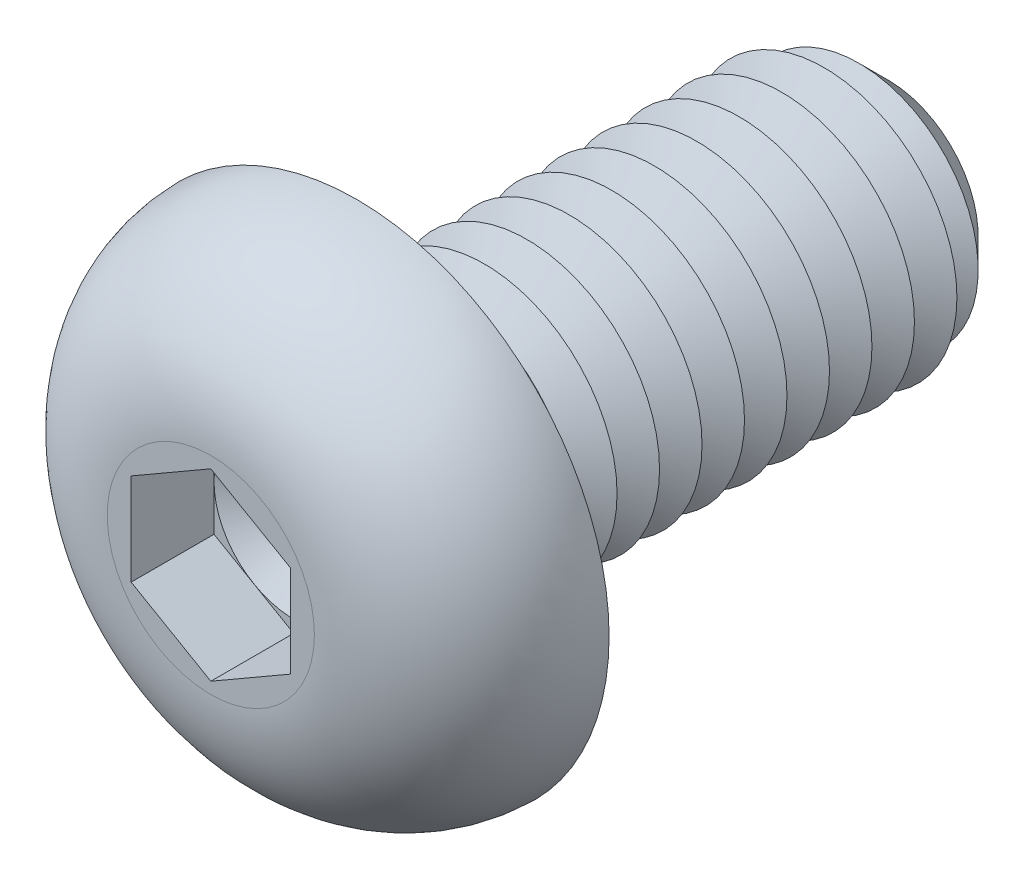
from build123d import *

# Parameters (mm, degrees)
CUT_EXTRUDE1_DEPTH  = 1.56
SKETCH4_R           = 2.5
BOSS_EXTRUDE1_DEPTH = 10
CHAMFER1_SIZE       = 0.8
LPATTERN1_COUNT     = 11
LPATTERN1_PITCH     = 0.8
FILLET2_R           = 0.4


with BuildPart() as part:
    # Sketch2 → Revolve1 (revolve)
    with BuildSketch(Plane(origin=(0, 0, 0), x_dir=(0, 0, -1), z_dir=(1, 0, 0)), mode=Mode.PRIVATE) as revolve1_sk:
        with BuildLine():
            Line((0, 0), (-2.75, 0))
            Line((-2.75, 0), (-2.75, 1.950446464))
            ThreePointArc((-2.75, 1.950446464), (-1.947498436, 3.912588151), (0, 4.75))
            Line((0, 4.75), (0, 0))
        make_face()
    revolve(revolve1_sk.sketch.rotate(Axis((0, 0, 47.934239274), (0, 0, -1)), 90), axis=Axis((0, 0, 47.934239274), (0, 0, -1)))

    # Sketch3 → Cut-Extrude1 (cut)
    with BuildSketch(Plane.XY.offset(2.75)):
        Polygon((0, 1.732050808), (-1.5, 0.866025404), (-1.5, -0.866025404), (0, -1.732050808), (1.5, -0.866025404), (1.5, 0.866025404), align=None)
    extrude(amount=-CUT_EXTRUDE1_DEPTH, mode=Mode.SUBTRACT)

    # Sketch4 → Boss-Extrude1 (add)
    with BuildSketch(Plane(origin=(0, 0, 0), x_dir=(-1, 0, 0), z_dir=(0, 0, -1))):
        with Locations(Location((0, 0, 0), (0, 0, 180))):
            Circle(SKETCH4_R)
    extrude(amount=BOSS_EXTRUDE1_DEPTH)

    # Chamfer1
    chamfer1_edges = [part.edges().sort_by_distance(p)[0] for p in [
        (-2.5, 0, -10),
    ]]
    chamfer(chamfer1_edges, length=CHAMFER1_SIZE)

    # Sketch5 → Cut-Revolve1 (revolve, cut)
    with BuildSketch(Plane(origin=(0, 0, 0), x_dir=(0, 0, -1), z_dir=(1, 0, 0)), mode=Mode.PRIVATE) as cut_revolve1_sk:
        Polygon((0.8, 2.5), (1.6, 2.5), (1.2, 1.807179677), align=None)
    cut_revolve1 = revolve(cut_revolve1_sk.sketch.rotate(Axis((0, 0, 47.934239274), (0, 0, -1)), 90), axis=Axis((0, 0, 47.934239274), (0, 0, -1)), mode=Mode.SUBTRACT)

    # LPattern1: Cut-Revolve1 ×11
    with Locations(*[(0, 0, -i * LPATTERN1_PITCH) for i in range(1, LPATTERN1_COUNT)]):
        add(cut_revolve1, mode=Mode.SUBTRACT)

    # Fillet2
    fillet2_edges = [part.edges().sort_by_distance(p)[0] for p in [
        (-2.5, 0, 0),
    ]]
    fillet(fillet2_edges, radius=FILLET2_R)

    # Cut-Extrude2 cone 1 section (on through the dimple's axis) → Cut-Extrude2 (revolve, cut)
    with BuildSketch(Plane(origin=(0, 0, 1.19), x_dir=(0, -1, 0), z_dir=(1, 0, 0))):
        Polygon((0, 0), (1.5, 0), (0, 0.866025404), align=None)
    revolve(axis=Axis((0, 0, 1.19), (0, 0, -1)), mode=Mode.SUBTRACT)


solid = part.part
